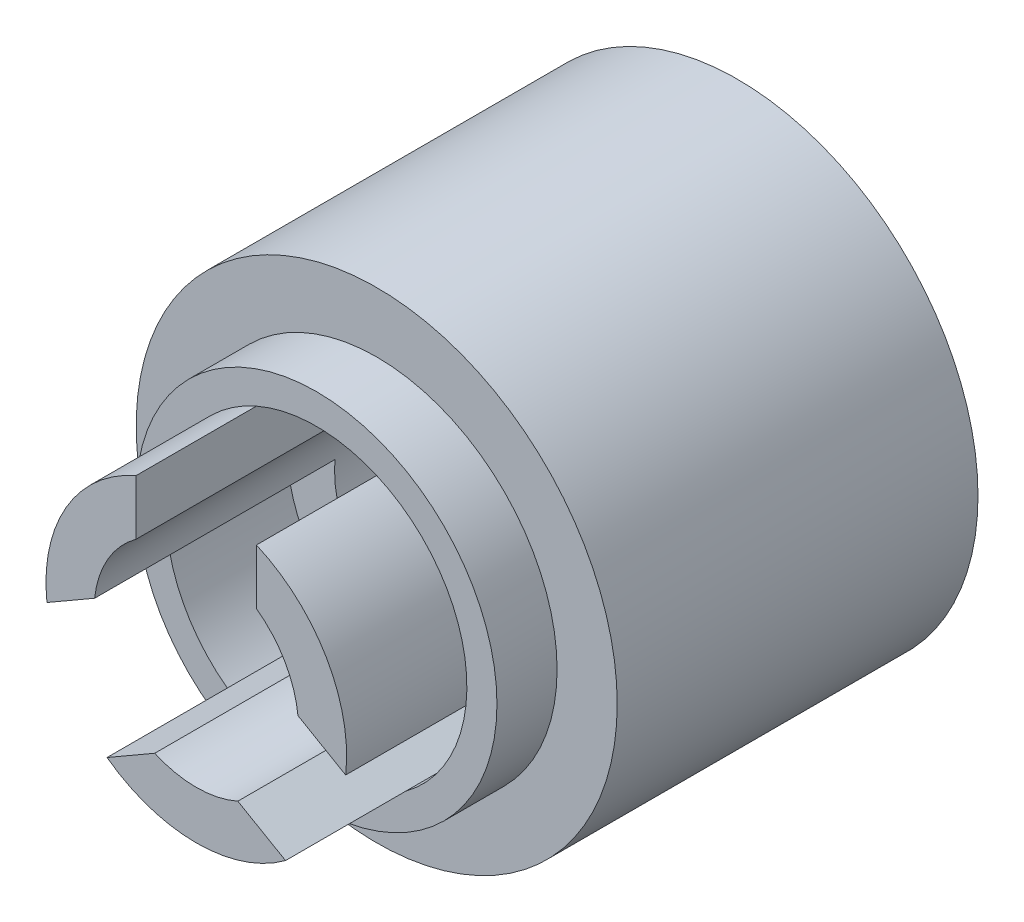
ISO-10303-21;
HEADER;
FILE_DESCRIPTION(('STEP AP214'),'2;1');
FILE_NAME('part.step','',(''),(''),'','','');
FILE_SCHEMA(('AUTOMOTIVE_DESIGN { 1 0 10303 214 1 1 1 1 }'));
ENDSEC;
DATA;
#1=APPLICATION_CONTEXT('core data for automotive mechanical design processes');
#2=APPLICATION_PROTOCOL_DEFINITION('international standard','automotive_design',2000,#1);
#3=PRODUCT_CONTEXT('',#1,'mechanical');
#4=PRODUCT('Part','Part','',(#3));
#5=PRODUCT_RELATED_PRODUCT_CATEGORY('part','',(#4));
#6=PRODUCT_DEFINITION_FORMATION('','',#4);
#7=PRODUCT_DEFINITION_CONTEXT('part definition',#1,'design');
#8=PRODUCT_DEFINITION('design','',#6,#7);
#9=PRODUCT_DEFINITION_SHAPE('','',#8);
#10=(LENGTH_UNIT() NAMED_UNIT(*) SI_UNIT(.MILLI.,.METRE.));
#11=(NAMED_UNIT(*) PLANE_ANGLE_UNIT() SI_UNIT($,.RADIAN.));
#12=(NAMED_UNIT(*) SI_UNIT($,.STERADIAN.) SOLID_ANGLE_UNIT());
#13=UNCERTAINTY_MEASURE_WITH_UNIT(LENGTH_MEASURE(1.E-05),#10,'distance_accuracy_value','');
#14=(GEOMETRIC_REPRESENTATION_CONTEXT(3) GLOBAL_UNCERTAINTY_ASSIGNED_CONTEXT((#13)) GLOBAL_UNIT_ASSIGNED_CONTEXT((#10,
#11,#12)) REPRESENTATION_CONTEXT('',''));
#15=CARTESIAN_POINT('',(0.,0.,0.));
#16=DIRECTION('',(0.,0.,1.));
#17=DIRECTION('',(1.,0.,0.));
#18=AXIS2_PLACEMENT_3D('',#15,#16,#17);
#19=CARTESIAN_POINT('',(0.,0.,1.27));
#20=DIRECTION('',(0.,0.,1.));
#21=DIRECTION('',(1.,0.,0.));
#22=AXIS2_PLACEMENT_3D('',#19,#20,#21);
#23=PLANE('',#22);
#24=CARTESIAN_POINT('',(0.,0.,1.27));
#25=DIRECTION('',(0.,0.,1.));
#26=DIRECTION('',(1.,0.,0.));
#27=AXIS2_PLACEMENT_3D('',#24,#25,#26);
#28=CIRCLE('',#27,3.81);
#29=CARTESIAN_POINT('',(3.81,0.,1.27));
#30=VERTEX_POINT('',#29);
#31=EDGE_CURVE('E264',#30,#30,#28,.T.);
#32=ORIENTED_EDGE('',*,*,#31,.T.);
#33=EDGE_LOOP('',(#32));
#34=FACE_BOUND('',#33,.T.);
#35=CARTESIAN_POINT('',(0.,0.,1.27));
#36=DIRECTION('',(0.,0.,1.));
#37=DIRECTION('',(1.,0.,0.));
#38=AXIS2_PLACEMENT_3D('',#35,#36,#37);
#39=CIRCLE('',#38,3.175);
#40=CARTESIAN_POINT('',(1.88507812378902,-2.55482004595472,1.27));
#41=VERTEX_POINT('',#40);
#42=CARTESIAN_POINT('',(3.15507812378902,-0.355115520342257,1.27));
#43=VERTEX_POINT('',#42);
#44=EDGE_CURVE('E267',#41,#43,#39,.T.);
#45=ORIENTED_EDGE('',*,*,#44,.F.);
#46=CARTESIAN_POINT('',(0.,0.,1.27));
#47=DIRECTION('',(0.,0.,1.));
#48=DIRECTION('',(1.,0.,0.));
#49=AXIS2_PLACEMENT_3D('',#46,#47,#48);
#50=CIRCLE('',#49,3.175);
#51=CARTESIAN_POINT('',(-1.88507812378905,-2.5548200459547,1.27));
#52=VERTEX_POINT('',#51);
#53=EDGE_CURVE('E180',#52,#41,#50,.T.);
#54=ORIENTED_EDGE('',*,*,#53,.F.);
#55=CARTESIAN_POINT('',(0.,0.,1.27));
#56=DIRECTION('',(0.,0.,1.));
#57=DIRECTION('',(1.,0.,0.));
#58=AXIS2_PLACEMENT_3D('',#55,#56,#57);
#59=CIRCLE('',#58,3.175);
#60=CARTESIAN_POINT('',(-3.15507812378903,-0.355115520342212,1.27));
#61=VERTEX_POINT('',#60);
#62=EDGE_CURVE('E270',#61,#52,#59,.T.);
#63=ORIENTED_EDGE('',*,*,#62,.F.);
#64=CARTESIAN_POINT('',(0.,0.,1.27));
#65=DIRECTION('',(0.,0.,1.));
#66=DIRECTION('',(1.,0.,0.));
#67=AXIS2_PLACEMENT_3D('',#64,#65,#66);
#68=CIRCLE('',#67,3.175);
#69=CARTESIAN_POINT('',(-1.27,2.90993556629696,1.27));
#70=VERTEX_POINT('',#69);
#71=EDGE_CURVE('E230',#70,#61,#68,.T.);
#72=ORIENTED_EDGE('',*,*,#71,.F.);
#73=CARTESIAN_POINT('',(0.,0.,1.27));
#74=DIRECTION('',(0.,0.,1.));
#75=DIRECTION('',(1.,0.,0.));
#76=AXIS2_PLACEMENT_3D('',#73,#74,#75);
#77=CIRCLE('',#76,3.175);
#78=CARTESIAN_POINT('',(1.27,2.90993556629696,1.27));
#79=VERTEX_POINT('',#78);
#80=EDGE_CURVE('E273',#79,#70,#77,.T.);
#81=ORIENTED_EDGE('',*,*,#80,.F.);
#82=CARTESIAN_POINT('',(0.,0.,1.27));
#83=DIRECTION('',(0.,0.,1.));
#84=DIRECTION('',(1.,0.,0.));
#85=AXIS2_PLACEMENT_3D('',#82,#83,#84);
#86=CIRCLE('',#85,3.175);
#87=EDGE_CURVE('E52',#43,#79,#86,.T.);
#88=ORIENTED_EDGE('',*,*,#87,.F.);
#89=EDGE_LOOP('',(#45,#54,#63,#72,#81,#88));
#90=FACE_BOUND('',#89,.T.);
#91=ADVANCED_FACE('F35',(#34,#90),#23,.T.);
#92=CARTESIAN_POINT('',(0.,0.,1.27));
#93=DIRECTION('',(0.,0.,-1.));
#94=DIRECTION('',(-1.,0.,0.));
#95=AXIS2_PLACEMENT_3D('',#92,#93,#94);
#96=CYLINDRICAL_SURFACE('',#95,2.159);
#97=CARTESIAN_POINT('',(0.,0.,-1.27));
#98=DIRECTION('',(0.,0.,-1.));
#99=DIRECTION('',(1.,0.,0.));
#100=AXIS2_PLACEMENT_3D('',#97,#98,#99);
#101=CIRCLE('',#100,2.159);
#102=CARTESIAN_POINT('',(-1.27,1.74596133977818,-1.27));
#103=VERTEX_POINT('',#102);
#104=CARTESIAN_POINT('',(1.27,1.74596133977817,-1.27));
#105=VERTEX_POINT('',#104);
#106=EDGE_CURVE('E151',#103,#105,#101,.T.);
#107=ORIENTED_EDGE('',*,*,#106,.F.);
#108=DIRECTION('',(0.,0.,-1.));
#109=VECTOR('',#108,1.);
#110=CARTESIAN_POINT('',(-1.27,1.74596133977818,1.27));
#111=LINE('',#110,#109);
#112=CARTESIAN_POINT('',(-1.27,1.74596133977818,3.81));
#113=VERTEX_POINT('',#112);
#114=EDGE_CURVE('E157',#103,#113,#111,.F.);
#115=ORIENTED_EDGE('',*,*,#114,.T.);
#116=CARTESIAN_POINT('',(0.,0.,3.81));
#117=DIRECTION('',(0.,0.,-1.));
#118=DIRECTION('',(1.,0.,0.));
#119=AXIS2_PLACEMENT_3D('',#116,#117,#118);
#120=CIRCLE('',#119,2.159);
#121=CARTESIAN_POINT('',(-2.14704687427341,0.22687159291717,3.81));
#122=VERTEX_POINT('',#121);
#123=EDGE_CURVE('E231',#122,#113,#120,.T.);
#124=ORIENTED_EDGE('',*,*,#123,.F.);
#125=DIRECTION('',(0.,0.,-1.));
#126=VECTOR('',#125,1.);
#127=CARTESIAN_POINT('',(-2.14704687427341,0.22687159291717,1.27));
#128=LINE('',#127,#126);
#129=CARTESIAN_POINT('',(-2.14704687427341,0.22687159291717,-1.27));
#130=VERTEX_POINT('',#129);
#131=EDGE_CURVE('E259',#130,#122,#128,.F.);
#132=ORIENTED_EDGE('',*,*,#131,.F.);
#133=CARTESIAN_POINT('',(0.,0.,-1.27));
#134=DIRECTION('',(0.,0.,-1.));
#135=DIRECTION('',(1.,0.,0.));
#136=AXIS2_PLACEMENT_3D('',#133,#134,#135);
#137=CIRCLE('',#136,2.159);
#138=CARTESIAN_POINT('',(-0.877046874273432,-1.97283293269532,-1.27));
#139=VERTEX_POINT('',#138);
#140=EDGE_CURVE('E190',#139,#130,#137,.T.);
#141=ORIENTED_EDGE('',*,*,#140,.F.);
#142=DIRECTION('',(0.,0.,-1.));
#143=VECTOR('',#142,1.);
#144=CARTESIAN_POINT('',(-0.877046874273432,-1.97283293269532,1.27));
#145=LINE('',#144,#143);
#146=CARTESIAN_POINT('',(-0.877046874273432,-1.97283293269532,3.81));
#147=VERTEX_POINT('',#146);
#148=EDGE_CURVE('E158',#139,#147,#145,.F.);
#149=ORIENTED_EDGE('',*,*,#148,.T.);
#150=CARTESIAN_POINT('',(0.,0.,3.81));
#151=DIRECTION('',(0.,0.,-1.));
#152=DIRECTION('',(1.,0.,0.));
#153=AXIS2_PLACEMENT_3D('',#150,#151,#152);
#154=CIRCLE('',#153,2.159);
#155=CARTESIAN_POINT('',(0.877046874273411,-1.97283293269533,3.81));
#156=VERTEX_POINT('',#155);
#157=EDGE_CURVE('E201',#156,#147,#154,.T.);
#158=ORIENTED_EDGE('',*,*,#157,.F.);
#159=DIRECTION('',(0.,0.,-1.));
#160=VECTOR('',#159,1.);
#161=CARTESIAN_POINT('',(0.877046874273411,-1.97283293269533,1.27));
#162=LINE('',#161,#160);
#163=CARTESIAN_POINT('',(0.877046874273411,-1.97283293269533,-1.27));
#164=VERTEX_POINT('',#163);
#165=EDGE_CURVE('E257',#164,#156,#162,.F.);
#166=ORIENTED_EDGE('',*,*,#165,.F.);
#167=CARTESIAN_POINT('',(0.,0.,-1.27));
#168=DIRECTION('',(0.,0.,-1.));
#169=DIRECTION('',(1.,0.,0.));
#170=AXIS2_PLACEMENT_3D('',#167,#168,#169);
#171=CIRCLE('',#170,2.159);
#172=CARTESIAN_POINT('',(2.14704687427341,0.22687159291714,-1.27));
#173=VERTEX_POINT('',#172);
#174=EDGE_CURVE('E181',#173,#164,#171,.T.);
#175=ORIENTED_EDGE('',*,*,#174,.F.);
#176=DIRECTION('',(0.,0.,-1.));
#177=VECTOR('',#176,1.);
#178=CARTESIAN_POINT('',(2.14704687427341,0.22687159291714,1.27));
#179=LINE('',#178,#177);
#180=CARTESIAN_POINT('',(2.14704687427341,0.22687159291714,3.81));
#181=VERTEX_POINT('',#180);
#182=EDGE_CURVE('E255',#173,#181,#179,.F.);
#183=ORIENTED_EDGE('',*,*,#182,.T.);
#184=CARTESIAN_POINT('',(0.,0.,3.81));
#185=DIRECTION('',(0.,0.,-1.));
#186=DIRECTION('',(1.,0.,0.));
#187=AXIS2_PLACEMENT_3D('',#184,#185,#186);
#188=CIRCLE('',#187,2.159);
#189=CARTESIAN_POINT('',(1.27,1.74596133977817,3.81));
#190=VERTEX_POINT('',#189);
#191=EDGE_CURVE('E153',#190,#181,#188,.T.);
#192=ORIENTED_EDGE('',*,*,#191,.F.);
#193=DIRECTION('',(0.,0.,-1.));
#194=VECTOR('',#193,1.);
#195=CARTESIAN_POINT('',(1.27,1.74596133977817,1.27));
#196=LINE('',#195,#194);
#197=EDGE_CURVE('E146',#105,#190,#196,.F.);
#198=ORIENTED_EDGE('',*,*,#197,.F.);
#199=EDGE_LOOP('',(#107,#115,#124,#132,#141,#149,#158,#166,#175,#183,#192,#198));
#200=FACE_BOUND('',#199,.T.);
#201=CARTESIAN_POINT('',(0.,0.,-2.54));
#202=DIRECTION('',(0.,0.,-1.));
#203=DIRECTION('',(-1.,0.,0.));
#204=AXIS2_PLACEMENT_3D('',#201,#202,#203);
#205=CIRCLE('',#204,2.159);
#206=CARTESIAN_POINT('',(-2.159,0.,-2.54));
#207=VERTEX_POINT('',#206);
#208=EDGE_CURVE('E39',#207,#207,#205,.F.);
#209=ORIENTED_EDGE('',*,*,#208,.F.);
#210=EDGE_LOOP('',(#209));
#211=FACE_BOUND('',#210,.T.);
#212=ADVANCED_FACE('F148',(#200,#211),#96,.F.);
#213=CARTESIAN_POINT('',(0.,0.,0.));
#214=DIRECTION('',(0.,0.,1.));
#215=DIRECTION('',(1.,0.,0.));
#216=AXIS2_PLACEMENT_3D('',#213,#214,#215);
#217=PLANE('',#216);
#218=CARTESIAN_POINT('',(0.,0.,0.));
#219=DIRECTION('',(0.,0.,1.));
#220=DIRECTION('',(1.,0.,0.));
#221=AXIS2_PLACEMENT_3D('',#218,#219,#220);
#222=CIRCLE('',#221,5.08);
#223=CARTESIAN_POINT('',(5.08,0.,0.));
#224=VERTEX_POINT('',#223);
#225=EDGE_CURVE('E44',#224,#224,#222,.T.);
#226=ORIENTED_EDGE('',*,*,#225,.T.);
#227=EDGE_LOOP('',(#226));
#228=FACE_BOUND('',#227,.T.);
#229=CARTESIAN_POINT('',(0.,0.,0.));
#230=DIRECTION('',(0.,0.,1.));
#231=DIRECTION('',(1.,0.,0.));
#232=AXIS2_PLACEMENT_3D('',#229,#230,#231);
#233=CIRCLE('',#232,3.81);
#234=CARTESIAN_POINT('',(3.81,0.,0.));
#235=VERTEX_POINT('',#234);
#236=EDGE_CURVE('E263',#235,#235,#233,.T.);
#237=ORIENTED_EDGE('',*,*,#236,.F.);
#238=EDGE_LOOP('',(#237));
#239=FACE_BOUND('',#238,.T.);
#240=ADVANCED_FACE('F290',(#228,#239),#217,.T.);
#241=CARTESIAN_POINT('',(0.,0.,-7.62));
#242=DIRECTION('',(0.,0.,1.));
#243=DIRECTION('',(1.,0.,0.));
#244=AXIS2_PLACEMENT_3D('',#241,#242,#243);
#245=CYLINDRICAL_SURFACE('',#244,5.08);
#246=CARTESIAN_POINT('',(0.,0.,-7.62));
#247=DIRECTION('',(0.,0.,1.));
#248=DIRECTION('',(1.,0.,0.));
#249=AXIS2_PLACEMENT_3D('',#246,#247,#248);
#250=CIRCLE('',#249,5.08);
#251=CARTESIAN_POINT('',(5.08,0.,-7.62));
#252=VERTEX_POINT('',#251);
#253=EDGE_CURVE('E11',#252,#252,#250,.T.);
#254=CARTESIAN_POINT('',(5.08,0.,-7.62));
#255=CARTESIAN_POINT('',(5.08,0.,-7.540625));
#256=CARTESIAN_POINT('',(5.08,0.,-7.46125));
#257=CARTESIAN_POINT('',(5.08,0.,-7.3025));
#258=CARTESIAN_POINT('',(5.08,0.,-7.223125));
#259=CARTESIAN_POINT('',(5.08,0.,-7.064375));
#260=CARTESIAN_POINT('',(5.08,0.,-6.985));
#261=CARTESIAN_POINT('',(5.08,0.,-6.82625));
#262=CARTESIAN_POINT('',(5.08,0.,-6.746875));
#263=CARTESIAN_POINT('',(5.08,0.,-6.588125));
#264=CARTESIAN_POINT('',(5.08,0.,-6.50875));
#265=CARTESIAN_POINT('',(5.08,0.,-6.35));
#266=CARTESIAN_POINT('',(5.08,0.,-6.270625));
#267=CARTESIAN_POINT('',(5.08,0.,-6.111875));
#268=CARTESIAN_POINT('',(5.08,0.,-6.0325));
#269=CARTESIAN_POINT('',(5.08,0.,-5.87375));
#270=CARTESIAN_POINT('',(5.08,0.,-5.794375));
#271=CARTESIAN_POINT('',(5.08,0.,-5.635625));
#272=CARTESIAN_POINT('',(5.08,0.,-5.55625));
#273=CARTESIAN_POINT('',(5.08,0.,-5.3975));
#274=CARTESIAN_POINT('',(5.08,0.,-5.318125));
#275=CARTESIAN_POINT('',(5.08,0.,-5.159375));
#276=CARTESIAN_POINT('',(5.08,0.,-5.08));
#277=CARTESIAN_POINT('',(5.08,0.,-4.92125));
#278=CARTESIAN_POINT('',(5.08,0.,-4.841875));
#279=CARTESIAN_POINT('',(5.08,0.,-4.683125));
#280=CARTESIAN_POINT('',(5.08,0.,-4.60375));
#281=CARTESIAN_POINT('',(5.08,0.,-4.445));
#282=CARTESIAN_POINT('',(5.08,0.,-4.365625));
#283=CARTESIAN_POINT('',(5.08,0.,-4.206875));
#284=CARTESIAN_POINT('',(5.08,0.,-4.1275));
#285=CARTESIAN_POINT('',(5.08,0.,-3.96875));
#286=CARTESIAN_POINT('',(5.08,0.,-3.889375));
#287=CARTESIAN_POINT('',(5.08,0.,-3.730625));
#288=CARTESIAN_POINT('',(5.08,0.,-3.65125));
#289=CARTESIAN_POINT('',(5.08,0.,-3.4925));
#290=CARTESIAN_POINT('',(5.08,0.,-3.413125));
#291=CARTESIAN_POINT('',(5.08,0.,-3.254375));
#292=CARTESIAN_POINT('',(5.08,0.,-3.175));
#293=CARTESIAN_POINT('',(5.08,0.,-3.01625));
#294=CARTESIAN_POINT('',(5.08,0.,-2.936875));
#295=CARTESIAN_POINT('',(5.08,0.,-2.778125));
#296=CARTESIAN_POINT('',(5.08,0.,-2.69875));
#297=CARTESIAN_POINT('',(5.08,0.,-2.54));
#298=CARTESIAN_POINT('',(5.08,0.,-2.460625));
#299=CARTESIAN_POINT('',(5.08,0.,-2.301875));
#300=CARTESIAN_POINT('',(5.08,0.,-2.2225));
#301=CARTESIAN_POINT('',(5.08,0.,-2.06375));
#302=CARTESIAN_POINT('',(5.08,0.,-1.984375));
#303=CARTESIAN_POINT('',(5.08,0.,-1.825625));
#304=CARTESIAN_POINT('',(5.08,0.,-1.74625));
#305=CARTESIAN_POINT('',(5.08,0.,-1.5875));
#306=CARTESIAN_POINT('',(5.08,0.,-1.508125));
#307=CARTESIAN_POINT('',(5.08,0.,-1.349375));
#308=CARTESIAN_POINT('',(5.08,0.,-1.27));
#309=CARTESIAN_POINT('',(5.08,0.,-1.11125));
#310=CARTESIAN_POINT('',(5.08,0.,-1.031875));
#311=CARTESIAN_POINT('',(5.08,0.,-0.873125));
#312=CARTESIAN_POINT('',(5.08,0.,-0.79375));
#313=CARTESIAN_POINT('',(5.08,0.,-0.635));
#314=CARTESIAN_POINT('',(5.08,0.,-0.555625));
#315=CARTESIAN_POINT('',(5.08,0.,-0.396875));
#316=CARTESIAN_POINT('',(5.08,0.,-0.3175));
#317=CARTESIAN_POINT('',(5.08,0.,-0.15875));
#318=CARTESIAN_POINT('',(5.08,0.,-0.0793749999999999));
#319=CARTESIAN_POINT('',(5.08,0.,0.));
#320=B_SPLINE_CURVE_WITH_KNOTS('',3,(#254,#255,#256,#257,#258,#259,#260,#261,#262,#263,#264,
#265,#266,#267,#268,#269,#270,#271,#272,#273,#274,#275,#276,#277,#278,#279,#280,#281,#282,#283,
#284,#285,#286,#287,#288,#289,#290,#291,#292,#293,#294,#295,#296,#297,#298,#299,#300,#301,#302,
#303,#304,#305,#306,#307,#308,#309,#310,#311,#312,#313,#314,#315,#316,#317,#318,#319),
.UNSPECIFIED.,.F.,.F.,(4,2,2,2,2,2,2,2,2,2,2,2,2,2,2,2,2,2,2,2,2,2,2,2,2,2,2,2,2,2,2,2,4),(0.,
0.238125,0.476249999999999,0.714375,0.952499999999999,1.190625,1.42875,1.666875,1.905,2.143125,
2.38125,2.619375,2.8575,3.095625,3.33375,3.571875,3.81,4.048125,4.28625,4.524375,4.7625,
5.000625,5.23875,5.476875,5.715,5.953125,6.19125,6.429375,6.6675,6.905625,7.14375,7.381875,
7.62),.UNSPECIFIED.);
#321=EDGE_CURVE('BSEAM37',#252,#224,#320,.T.);
#322=ORIENTED_EDGE('',*,*,#253,.T.);
#323=ORIENTED_EDGE('',*,*,#225,.F.);
#324=ORIENTED_EDGE('',*,*,#321,.T.);
#325=ORIENTED_EDGE('',*,*,#321,.F.);
#326=EDGE_LOOP('',(#322,#324,#323,#325));
#327=FACE_BOUND('',#326,.T.);
#328=ADVANCED_FACE('F37',(#327),#245,.T.);
#329=CARTESIAN_POINT('',(0.,0.,-7.62));
#330=DIRECTION('',(0.,0.,1.));
#331=DIRECTION('',(1.,0.,0.));
#332=AXIS2_PLACEMENT_3D('',#329,#330,#331);
#333=PLANE('',#332);
#334=CARTESIAN_POINT('',(0.,0.,-7.62));
#335=DIRECTION('',(0.,0.,-1.));
#336=DIRECTION('',(-1.,0.,0.));
#337=AXIS2_PLACEMENT_3D('',#334,#335,#336);
#338=CIRCLE('',#337,3.429);
#339=CARTESIAN_POINT('',(-3.429,0.,-7.62));
#340=VERTEX_POINT('',#339);
#341=EDGE_CURVE('E249',#340,#340,#338,.T.);
#342=ORIENTED_EDGE('',*,*,#341,.F.);
#343=EDGE_LOOP('',(#342));
#344=FACE_BOUND('',#343,.T.);
#345=ORIENTED_EDGE('',*,*,#253,.F.);
#346=EDGE_LOOP('',(#345));
#347=FACE_BOUND('',#346,.T.);
#348=ADVANCED_FACE('F294',(#344,#347),#333,.F.);
#349=CARTESIAN_POINT('',(0.,0.,1.27));
#350=DIRECTION('',(0.,0.,-1.));
#351=DIRECTION('',(-1.,0.,0.));
#352=AXIS2_PLACEMENT_3D('',#349,#350,#351);
#353=CYLINDRICAL_SURFACE('',#352,3.175);
#354=DIRECTION('',(0.,0.,-1.));
#355=VECTOR('',#354,1.);
#356=CARTESIAN_POINT('',(3.15507812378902,-0.355115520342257,1.27));
#357=LINE('',#356,#355);
#358=CARTESIAN_POINT('',(3.15507812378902,-0.355115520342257,-1.27));
#359=VERTEX_POINT('',#358);
#360=EDGE_CURVE('E275',#43,#359,#357,.T.);
#361=ORIENTED_EDGE('',*,*,#360,.T.);
#362=CARTESIAN_POINT('',(0.,0.,-1.27));
#363=DIRECTION('',(0.,0.,1.));
#364=DIRECTION('',(1.,0.,0.));
#365=AXIS2_PLACEMENT_3D('',#362,#363,#364);
#366=CIRCLE('',#365,3.175);
#367=CARTESIAN_POINT('',(1.88507812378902,-2.55482004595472,-1.27));
#368=VERTEX_POINT('',#367);
#369=EDGE_CURVE('E175',#368,#359,#366,.T.);
#370=ORIENTED_EDGE('',*,*,#369,.F.);
#371=DIRECTION('',(0.,0.,-1.));
#372=VECTOR('',#371,1.);
#373=CARTESIAN_POINT('',(1.88507812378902,-2.55482004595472,1.27));
#374=LINE('',#373,#372);
#375=EDGE_CURVE('E286',#41,#368,#374,.T.);
#376=ORIENTED_EDGE('',*,*,#375,.F.);
#377=ORIENTED_EDGE('',*,*,#44,.T.);
#378=EDGE_LOOP('',(#361,#370,#376,#377));
#379=FACE_BOUND('',#378,.T.);
#380=ADVANCED_FACE('F300',(#379),#353,.F.);
#381=CARTESIAN_POINT('',(-0.635,-1.09985226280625,1.27));
#382=DIRECTION('',(-0.499999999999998,-0.86602540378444,0.));
#383=DIRECTION('',(0.86602540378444,-0.499999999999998,0.));
#384=AXIS2_PLACEMENT_3D('',#381,#382,#383);
#385=PLANE('',#384);
#386=ORIENTED_EDGE('',*,*,#375,.T.);
#387=DIRECTION('',(0.86602540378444,-0.499999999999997,0.));
#388=VECTOR('',#387,1.);
#389=CARTESIAN_POINT('',(0.877046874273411,-1.97283293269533,-1.27));
#390=LINE('',#389,#388);
#391=EDGE_CURVE('E184',#164,#368,#390,.T.);
#392=ORIENTED_EDGE('',*,*,#391,.F.);
#393=ORIENTED_EDGE('',*,*,#165,.T.);
#394=DIRECTION('',(-0.86602540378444,0.499999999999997,0.));
#395=VECTOR('',#394,1.);
#396=CARTESIAN_POINT('',(0.877046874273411,-1.97283293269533,3.81));
#397=LINE('',#396,#395);
#398=CARTESIAN_POINT('',(1.88507812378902,-2.55482004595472,3.81));
#399=VERTEX_POINT('',#398);
#400=EDGE_CURVE('E208',#399,#156,#397,.T.);
#401=ORIENTED_EDGE('',*,*,#400,.F.);
#402=DIRECTION('',(0.,0.,-1.));
#403=VECTOR('',#402,1.);
#404=CARTESIAN_POINT('',(1.88507812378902,-2.55482004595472,3.81));
#405=LINE('',#404,#403);
#406=EDGE_CURVE('E211',#399,#41,#405,.T.);
#407=ORIENTED_EDGE('',*,*,#406,.T.);
#408=EDGE_LOOP('',(#386,#392,#393,#401,#407));
#409=FACE_BOUND('',#408,.T.);
#410=ADVANCED_FACE('F338',(#409),#385,.F.);
#411=CARTESIAN_POINT('',(0.63499999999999,-1.09985226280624,1.27));
#412=DIRECTION('',(-0.499999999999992,0.866025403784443,0.));
#413=DIRECTION('',(-0.866025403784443,-0.499999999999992,0.));
#414=AXIS2_PLACEMENT_3D('',#411,#412,#413);
#415=PLANE('',#414);
#416=ORIENTED_EDGE('',*,*,#148,.F.);
#417=DIRECTION('',(0.866025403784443,0.499999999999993,0.));
#418=VECTOR('',#417,1.);
#419=CARTESIAN_POINT('',(-0.877046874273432,-1.97283293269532,-1.27));
#420=LINE('',#419,#418);
#421=CARTESIAN_POINT('',(-1.88507812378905,-2.5548200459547,-1.27));
#422=VERTEX_POINT('',#421);
#423=EDGE_CURVE('E185',#422,#139,#420,.T.);
#424=ORIENTED_EDGE('',*,*,#423,.F.);
#425=DIRECTION('',(0.,0.,-1.));
#426=VECTOR('',#425,1.);
#427=CARTESIAN_POINT('',(-1.88507812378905,-2.5548200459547,1.27));
#428=LINE('',#427,#426);
#429=EDGE_CURVE('E284',#52,#422,#428,.T.);
#430=ORIENTED_EDGE('',*,*,#429,.F.);
#431=DIRECTION('',(0.,0.,-1.));
#432=VECTOR('',#431,1.);
#433=CARTESIAN_POINT('',(-1.88507812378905,-2.5548200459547,3.81));
#434=LINE('',#433,#432);
#435=CARTESIAN_POINT('',(-1.88507812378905,-2.5548200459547,3.81));
#436=VERTEX_POINT('',#435);
#437=EDGE_CURVE('E215',#436,#52,#434,.T.);
#438=ORIENTED_EDGE('',*,*,#437,.F.);
#439=DIRECTION('',(-0.866025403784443,-0.499999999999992,0.));
#440=VECTOR('',#439,1.);
#441=CARTESIAN_POINT('',(-0.877046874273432,-1.97283293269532,3.81));
#442=LINE('',#441,#440);
#443=EDGE_CURVE('E204',#147,#436,#442,.T.);
#444=ORIENTED_EDGE('',*,*,#443,.F.);
#445=EDGE_LOOP('',(#416,#424,#430,#438,#444));
#446=FACE_BOUND('',#445,.T.);
#447=ADVANCED_FACE('F334',(#446),#415,.T.);
#448=CARTESIAN_POINT('',(0.,0.,1.27));
#449=DIRECTION('',(0.,0.,-1.));
#450=DIRECTION('',(-1.,0.,0.));
#451=AXIS2_PLACEMENT_3D('',#448,#449,#450);
#452=CYLINDRICAL_SURFACE('',#451,3.175);
#453=ORIENTED_EDGE('',*,*,#429,.T.);
#454=CARTESIAN_POINT('',(0.,0.,-1.27));
#455=DIRECTION('',(0.,0.,1.));
#456=DIRECTION('',(1.,0.,0.));
#457=AXIS2_PLACEMENT_3D('',#454,#455,#456);
#458=CIRCLE('',#457,3.175);
#459=CARTESIAN_POINT('',(-3.15507812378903,-0.355115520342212,-1.27));
#460=VERTEX_POINT('',#459);
#461=EDGE_CURVE('E196',#460,#422,#458,.T.);
#462=ORIENTED_EDGE('',*,*,#461,.F.);
#463=DIRECTION('',(0.,0.,-1.));
#464=VECTOR('',#463,1.);
#465=CARTESIAN_POINT('',(-3.15507812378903,-0.355115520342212,1.27));
#466=LINE('',#465,#464);
#467=EDGE_CURVE('E282',#61,#460,#466,.T.);
#468=ORIENTED_EDGE('',*,*,#467,.F.);
#469=ORIENTED_EDGE('',*,*,#62,.T.);
#470=EDGE_LOOP('',(#453,#462,#468,#469));
#471=FACE_BOUND('',#470,.T.);
#472=ADVANCED_FACE('F330',(#471),#452,.F.);
#473=CARTESIAN_POINT('',(-0.63499999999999,1.09985226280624,1.27));
#474=DIRECTION('',(-0.499999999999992,0.866025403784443,0.));
#475=DIRECTION('',(-0.866025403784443,-0.499999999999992,0.));
#476=AXIS2_PLACEMENT_3D('',#473,#474,#475);
#477=PLANE('',#476);
#478=ORIENTED_EDGE('',*,*,#467,.T.);
#479=DIRECTION('',(-0.866025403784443,-0.499999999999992,0.));
#480=VECTOR('',#479,1.);
#481=CARTESIAN_POINT('',(-2.14704687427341,0.22687159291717,-1.27));
#482=LINE('',#481,#480);
#483=EDGE_CURVE('E193',#130,#460,#482,.T.);
#484=ORIENTED_EDGE('',*,*,#483,.F.);
#485=ORIENTED_EDGE('',*,*,#131,.T.);
#486=DIRECTION('',(0.866025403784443,0.499999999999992,0.));
#487=VECTOR('',#486,1.);
#488=CARTESIAN_POINT('',(-2.14704687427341,0.22687159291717,3.81));
#489=LINE('',#488,#487);
#490=CARTESIAN_POINT('',(-3.15507812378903,-0.355115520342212,3.81));
#491=VERTEX_POINT('',#490);
#492=EDGE_CURVE('E238',#491,#122,#489,.T.);
#493=ORIENTED_EDGE('',*,*,#492,.F.);
#494=DIRECTION('',(0.,0.,-1.));
#495=VECTOR('',#494,1.);
#496=CARTESIAN_POINT('',(-3.15507812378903,-0.355115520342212,3.81));
#497=LINE('',#496,#495);
#498=EDGE_CURVE('E241',#491,#61,#497,.T.);
#499=ORIENTED_EDGE('',*,*,#498,.T.);
#500=EDGE_LOOP('',(#478,#484,#485,#493,#499));
#501=FACE_BOUND('',#500,.T.);
#502=ADVANCED_FACE('F326',(#501),#477,.F.);
#503=CARTESIAN_POINT('',(-1.27,0.,1.27));
#504=DIRECTION('',(1.,0.,0.));
#505=DIRECTION('',(0.,1.,0.));
#506=AXIS2_PLACEMENT_3D('',#503,#504,#505);
#507=PLANE('',#506);
#508=ORIENTED_EDGE('',*,*,#114,.F.);
#509=DIRECTION('',(0.,-1.,0.));
#510=VECTOR('',#509,1.);
#511=CARTESIAN_POINT('',(-1.27,1.74596133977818,-1.27));
#512=LINE('',#511,#510);
#513=CARTESIAN_POINT('',(-1.27,2.90993556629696,-1.27));
#514=VERTEX_POINT('',#513);
#515=EDGE_CURVE('E171',#514,#103,#512,.T.);
#516=ORIENTED_EDGE('',*,*,#515,.F.);
#517=DIRECTION('',(0.,0.,-1.));
#518=VECTOR('',#517,1.);
#519=CARTESIAN_POINT('',(-1.27,2.90993556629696,1.27));
#520=LINE('',#519,#518);
#521=EDGE_CURVE('E280',#70,#514,#520,.T.);
#522=ORIENTED_EDGE('',*,*,#521,.F.);
#523=DIRECTION('',(0.,0.,-1.));
#524=VECTOR('',#523,1.);
#525=CARTESIAN_POINT('',(-1.27,2.90993556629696,3.81));
#526=LINE('',#525,#524);
#527=CARTESIAN_POINT('',(-1.27,2.90993556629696,3.81));
#528=VERTEX_POINT('',#527);
#529=EDGE_CURVE('E246',#528,#70,#526,.T.);
#530=ORIENTED_EDGE('',*,*,#529,.F.);
#531=DIRECTION('',(0.,1.,0.));
#532=VECTOR('',#531,1.);
#533=CARTESIAN_POINT('',(-1.27,1.74596133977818,3.81));
#534=LINE('',#533,#532);
#535=EDGE_CURVE('E234',#113,#528,#534,.T.);
#536=ORIENTED_EDGE('',*,*,#535,.F.);
#537=EDGE_LOOP('',(#508,#516,#522,#530,#536));
#538=FACE_BOUND('',#537,.T.);
#539=ADVANCED_FACE('F323',(#538),#507,.T.);
#540=CARTESIAN_POINT('',(0.,0.,1.27));
#541=DIRECTION('',(0.,0.,-1.));
#542=DIRECTION('',(-1.,0.,0.));
#543=AXIS2_PLACEMENT_3D('',#540,#541,#542);
#544=CYLINDRICAL_SURFACE('',#543,3.175);
#545=ORIENTED_EDGE('',*,*,#521,.T.);
#546=CARTESIAN_POINT('',(0.,0.,-1.27));
#547=DIRECTION('',(0.,0.,1.));
#548=DIRECTION('',(1.,0.,0.));
#549=AXIS2_PLACEMENT_3D('',#546,#547,#548);
#550=CIRCLE('',#549,3.175);
#551=CARTESIAN_POINT('',(1.27,2.90993556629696,-1.27));
#552=VERTEX_POINT('',#551);
#553=EDGE_CURVE('E166',#552,#514,#550,.T.);
#554=ORIENTED_EDGE('',*,*,#553,.F.);
#555=DIRECTION('',(0.,0.,-1.));
#556=VECTOR('',#555,1.);
#557=CARTESIAN_POINT('',(1.27,2.90993556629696,1.27));
#558=LINE('',#557,#556);
#559=EDGE_CURVE('E60',#79,#552,#558,.T.);
#560=ORIENTED_EDGE('',*,*,#559,.F.);
#561=ORIENTED_EDGE('',*,*,#80,.T.);
#562=EDGE_LOOP('',(#545,#554,#560,#561));
#563=FACE_BOUND('',#562,.T.);
#564=ADVANCED_FACE('F320',(#563),#544,.F.);
#565=CARTESIAN_POINT('',(1.27,0.,1.27));
#566=DIRECTION('',(1.,0.,0.));
#567=DIRECTION('',(0.,1.,0.));
#568=AXIS2_PLACEMENT_3D('',#565,#566,#567);
#569=PLANE('',#568);
#570=ORIENTED_EDGE('',*,*,#559,.T.);
#571=DIRECTION('',(0.,1.,0.));
#572=VECTOR('',#571,1.);
#573=CARTESIAN_POINT('',(1.27,1.74596133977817,-1.27));
#574=LINE('',#573,#572);
#575=EDGE_CURVE('E161',#105,#552,#574,.T.);
#576=ORIENTED_EDGE('',*,*,#575,.F.);
#577=ORIENTED_EDGE('',*,*,#197,.T.);
#578=DIRECTION('',(0.,-1.,0.));
#579=VECTOR('',#578,1.);
#580=CARTESIAN_POINT('',(1.27,1.74596133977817,3.81));
#581=LINE('',#580,#579);
#582=CARTESIAN_POINT('',(1.27,2.90993556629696,3.81));
#583=VERTEX_POINT('',#582);
#584=EDGE_CURVE('E222',#583,#190,#581,.T.);
#585=ORIENTED_EDGE('',*,*,#584,.F.);
#586=DIRECTION('',(0.,0.,-1.));
#587=VECTOR('',#586,1.);
#588=CARTESIAN_POINT('',(1.27,2.90993556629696,3.81));
#589=LINE('',#588,#587);
#590=EDGE_CURVE('E224',#583,#79,#589,.T.);
#591=ORIENTED_EDGE('',*,*,#590,.T.);
#592=EDGE_LOOP('',(#570,#576,#577,#585,#591));
#593=FACE_BOUND('',#592,.T.);
#594=ADVANCED_FACE('F162',(#593),#569,.F.);
#595=CARTESIAN_POINT('',(0.,0.,1.27));
#596=DIRECTION('',(0.,0.,-1.));
#597=DIRECTION('',(-1.,0.,0.));
#598=AXIS2_PLACEMENT_3D('',#595,#596,#597);
#599=CYLINDRICAL_SURFACE('',#598,3.81);
#600=ORIENTED_EDGE('',*,*,#31,.F.);
#601=EDGE_LOOP('',(#600));
#602=FACE_BOUND('',#601,.T.);
#603=ORIENTED_EDGE('',*,*,#236,.T.);
#604=EDGE_LOOP('',(#603));
#605=FACE_BOUND('',#604,.T.);
#606=ADVANCED_FACE('F316',(#602,#605),#599,.T.);
#607=CARTESIAN_POINT('',(0.635000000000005,1.09985226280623,1.27));
#608=DIRECTION('',(-0.500000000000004,-0.866025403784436,0.));
#609=DIRECTION('',(0.866025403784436,-0.500000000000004,0.));
#610=AXIS2_PLACEMENT_3D('',#607,#608,#609);
#611=PLANE('',#610);
#612=ORIENTED_EDGE('',*,*,#182,.F.);
#613=DIRECTION('',(-0.866025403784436,0.500000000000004,0.));
#614=VECTOR('',#613,1.);
#615=CARTESIAN_POINT('',(2.14704687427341,0.22687159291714,-1.27));
#616=LINE('',#615,#614);
#617=EDGE_CURVE('E172',#359,#173,#616,.T.);
#618=ORIENTED_EDGE('',*,*,#617,.F.);
#619=ORIENTED_EDGE('',*,*,#360,.F.);
#620=DIRECTION('',(0.,0.,-1.));
#621=VECTOR('',#620,1.);
#622=CARTESIAN_POINT('',(3.15507812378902,-0.355115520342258,3.81));
#623=LINE('',#622,#621);
#624=CARTESIAN_POINT('',(3.15507812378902,-0.355115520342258,3.81));
#625=VERTEX_POINT('',#624);
#626=EDGE_CURVE('E227',#625,#43,#623,.T.);
#627=ORIENTED_EDGE('',*,*,#626,.F.);
#628=DIRECTION('',(0.866025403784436,-0.500000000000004,0.));
#629=VECTOR('',#628,1.);
#630=CARTESIAN_POINT('',(2.14704687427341,0.22687159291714,3.81));
#631=LINE('',#630,#629);
#632=EDGE_CURVE('E218',#181,#625,#631,.T.);
#633=ORIENTED_EDGE('',*,*,#632,.F.);
#634=EDGE_LOOP('',(#612,#618,#619,#627,#633));
#635=FACE_BOUND('',#634,.T.);
#636=ADVANCED_FACE('F312',(#635),#611,.T.);
#637=CARTESIAN_POINT('',(0.,0.,-2.54));
#638=DIRECTION('',(0.,0.,-1.));
#639=DIRECTION('',(-1.,0.,0.));
#640=AXIS2_PLACEMENT_3D('',#637,#638,#639);
#641=PLANE('',#640);
#642=CARTESIAN_POINT('',(0.,0.,-2.54));
#643=DIRECTION('',(0.,0.,-1.));
#644=DIRECTION('',(-1.,0.,0.));
#645=AXIS2_PLACEMENT_3D('',#642,#643,#644);
#646=CIRCLE('',#645,3.429);
#647=CARTESIAN_POINT('',(-3.429,0.,-2.54));
#648=VERTEX_POINT('',#647);
#649=EDGE_CURVE('E250',#648,#648,#646,.T.);
#650=ORIENTED_EDGE('',*,*,#649,.T.);
#651=EDGE_LOOP('',(#650));
#652=FACE_BOUND('',#651,.T.);
#653=ORIENTED_EDGE('',*,*,#208,.T.);
#654=EDGE_LOOP('',(#653));
#655=FACE_BOUND('',#654,.T.);
#656=ADVANCED_FACE('F315',(#652,#655),#641,.T.);
#657=CARTESIAN_POINT('',(0.,0.,-2.54));
#658=DIRECTION('',(0.,0.,-1.));
#659=DIRECTION('',(-1.,0.,0.));
#660=AXIS2_PLACEMENT_3D('',#657,#658,#659);
#661=CYLINDRICAL_SURFACE('',#660,3.429);
#662=ORIENTED_EDGE('',*,*,#649,.F.);
#663=EDGE_LOOP('',(#662));
#664=FACE_BOUND('',#663,.T.);
#665=ORIENTED_EDGE('',*,*,#341,.T.);
#666=EDGE_LOOP('',(#665));
#667=FACE_BOUND('',#666,.T.);
#668=ADVANCED_FACE('F368',(#664,#667),#661,.F.);
#669=CARTESIAN_POINT('',(0.,0.,3.81));
#670=DIRECTION('',(0.,0.,-1.));
#671=DIRECTION('',(-1.,0.,0.));
#672=AXIS2_PLACEMENT_3D('',#669,#670,#671);
#673=CYLINDRICAL_SURFACE('',#672,3.175);
#674=ORIENTED_EDGE('',*,*,#71,.T.);
#675=ORIENTED_EDGE('',*,*,#498,.F.);
#676=CARTESIAN_POINT('',(0.,0.,3.81));
#677=DIRECTION('',(0.,0.,1.));
#678=DIRECTION('',(1.,0.,0.));
#679=AXIS2_PLACEMENT_3D('',#676,#677,#678);
#680=CIRCLE('',#679,3.175);
#681=EDGE_CURVE('E236',#528,#491,#680,.T.);
#682=ORIENTED_EDGE('',*,*,#681,.F.);
#683=ORIENTED_EDGE('',*,*,#529,.T.);
#684=EDGE_LOOP('',(#674,#675,#682,#683));
#685=FACE_BOUND('',#684,.T.);
#686=ADVANCED_FACE('F376',(#685),#673,.T.);
#687=CARTESIAN_POINT('',(0.,0.,3.81));
#688=DIRECTION('',(0.,0.,1.));
#689=DIRECTION('',(1.,0.,0.));
#690=AXIS2_PLACEMENT_3D('',#687,#688,#689);
#691=PLANE('',#690);
#692=ORIENTED_EDGE('',*,*,#123,.T.);
#693=ORIENTED_EDGE('',*,*,#535,.T.);
#694=ORIENTED_EDGE('',*,*,#681,.T.);
#695=ORIENTED_EDGE('',*,*,#492,.T.);
#696=EDGE_LOOP('',(#692,#693,#694,#695));
#697=FACE_BOUND('',#696,.T.);
#698=ADVANCED_FACE('F383',(#697),#691,.T.);
#699=CARTESIAN_POINT('',(0.,0.,3.81));
#700=DIRECTION('',(0.,0.,-1.));
#701=DIRECTION('',(-1.,0.,0.));
#702=AXIS2_PLACEMENT_3D('',#699,#700,#701);
#703=CYLINDRICAL_SURFACE('',#702,3.175);
#704=ORIENTED_EDGE('',*,*,#87,.T.);
#705=ORIENTED_EDGE('',*,*,#590,.F.);
#706=CARTESIAN_POINT('',(0.,0.,3.81));
#707=DIRECTION('',(0.,0.,1.));
#708=DIRECTION('',(1.,0.,0.));
#709=AXIS2_PLACEMENT_3D('',#706,#707,#708);
#710=CIRCLE('',#709,3.175);
#711=EDGE_CURVE('E220',#625,#583,#710,.T.);
#712=ORIENTED_EDGE('',*,*,#711,.F.);
#713=ORIENTED_EDGE('',*,*,#626,.T.);
#714=EDGE_LOOP('',(#704,#705,#712,#713));
#715=FACE_BOUND('',#714,.T.);
#716=ADVANCED_FACE('F391',(#715),#703,.T.);
#717=CARTESIAN_POINT('',(0.,0.,3.81));
#718=DIRECTION('',(0.,0.,1.));
#719=DIRECTION('',(1.,0.,0.));
#720=AXIS2_PLACEMENT_3D('',#717,#718,#719);
#721=PLANE('',#720);
#722=ORIENTED_EDGE('',*,*,#191,.T.);
#723=ORIENTED_EDGE('',*,*,#632,.T.);
#724=ORIENTED_EDGE('',*,*,#711,.T.);
#725=ORIENTED_EDGE('',*,*,#584,.T.);
#726=EDGE_LOOP('',(#722,#723,#724,#725));
#727=FACE_BOUND('',#726,.T.);
#728=ADVANCED_FACE('F399',(#727),#721,.T.);
#729=CARTESIAN_POINT('',(0.,0.,3.81));
#730=DIRECTION('',(0.,0.,-1.));
#731=DIRECTION('',(-1.,0.,0.));
#732=AXIS2_PLACEMENT_3D('',#729,#730,#731);
#733=CYLINDRICAL_SURFACE('',#732,3.175);
#734=ORIENTED_EDGE('',*,*,#53,.T.);
#735=ORIENTED_EDGE('',*,*,#406,.F.);
#736=CARTESIAN_POINT('',(0.,0.,3.81));
#737=DIRECTION('',(0.,0.,1.));
#738=DIRECTION('',(1.,0.,0.));
#739=AXIS2_PLACEMENT_3D('',#736,#737,#738);
#740=CIRCLE('',#739,3.175);
#741=EDGE_CURVE('E206',#436,#399,#740,.T.);
#742=ORIENTED_EDGE('',*,*,#741,.F.);
#743=ORIENTED_EDGE('',*,*,#437,.T.);
#744=EDGE_LOOP('',(#734,#735,#742,#743));
#745=FACE_BOUND('',#744,.T.);
#746=ADVANCED_FACE('F407',(#745),#733,.T.);
#747=CARTESIAN_POINT('',(0.,0.,3.81));
#748=DIRECTION('',(0.,0.,1.));
#749=DIRECTION('',(1.,0.,0.));
#750=AXIS2_PLACEMENT_3D('',#747,#748,#749);
#751=PLANE('',#750);
#752=ORIENTED_EDGE('',*,*,#157,.T.);
#753=ORIENTED_EDGE('',*,*,#443,.T.);
#754=ORIENTED_EDGE('',*,*,#741,.T.);
#755=ORIENTED_EDGE('',*,*,#400,.T.);
#756=EDGE_LOOP('',(#752,#753,#754,#755));
#757=FACE_BOUND('',#756,.T.);
#758=ADVANCED_FACE('F415',(#757),#751,.T.);
#759=CARTESIAN_POINT('',(0.,0.,-1.27));
#760=DIRECTION('',(0.,0.,1.));
#761=DIRECTION('',(1.,0.,0.));
#762=AXIS2_PLACEMENT_3D('',#759,#760,#761);
#763=PLANE('',#762);
#764=ORIENTED_EDGE('',*,*,#174,.T.);
#765=ORIENTED_EDGE('',*,*,#391,.T.);
#766=ORIENTED_EDGE('',*,*,#369,.T.);
#767=ORIENTED_EDGE('',*,*,#617,.T.);
#768=EDGE_LOOP('',(#764,#765,#766,#767));
#769=FACE_BOUND('',#768,.T.);
#770=ADVANCED_FACE('F423',(#769),#763,.T.);
#771=CARTESIAN_POINT('',(0.,0.,-1.27));
#772=DIRECTION('',(0.,0.,1.));
#773=DIRECTION('',(1.,0.,0.));
#774=AXIS2_PLACEMENT_3D('',#771,#772,#773);
#775=PLANE('',#774);
#776=ORIENTED_EDGE('',*,*,#106,.T.);
#777=ORIENTED_EDGE('',*,*,#575,.T.);
#778=ORIENTED_EDGE('',*,*,#553,.T.);
#779=ORIENTED_EDGE('',*,*,#515,.T.);
#780=EDGE_LOOP('',(#776,#777,#778,#779));
#781=FACE_BOUND('',#780,.T.);
#782=ADVANCED_FACE('F169',(#781),#775,.T.);
#783=CARTESIAN_POINT('',(0.,0.,-1.27));
#784=DIRECTION('',(0.,0.,1.));
#785=DIRECTION('',(1.,0.,0.));
#786=AXIS2_PLACEMENT_3D('',#783,#784,#785);
#787=PLANE('',#786);
#788=ORIENTED_EDGE('',*,*,#140,.T.);
#789=ORIENTED_EDGE('',*,*,#483,.T.);
#790=ORIENTED_EDGE('',*,*,#461,.T.);
#791=ORIENTED_EDGE('',*,*,#423,.T.);
#792=EDGE_LOOP('',(#788,#789,#790,#791));
#793=FACE_BOUND('',#792,.T.);
#794=ADVANCED_FACE('F438',(#793),#787,.T.);
#795=CLOSED_SHELL('',(#91,#212,#240,#328,#348,#380,#410,#447,#472,#502,#539,#564,#594,#606,#636,
#656,#668,#686,#698,#716,#728,#746,#758,#770,#782,#794));
#796=MANIFOLD_SOLID_BREP('B2',#795);
#797=ADVANCED_BREP_SHAPE_REPRESENTATION('',(#18,#796),#14);
#798=SHAPE_DEFINITION_REPRESENTATION(#9,#797);
ENDSEC;
END-ISO-10303-21;
